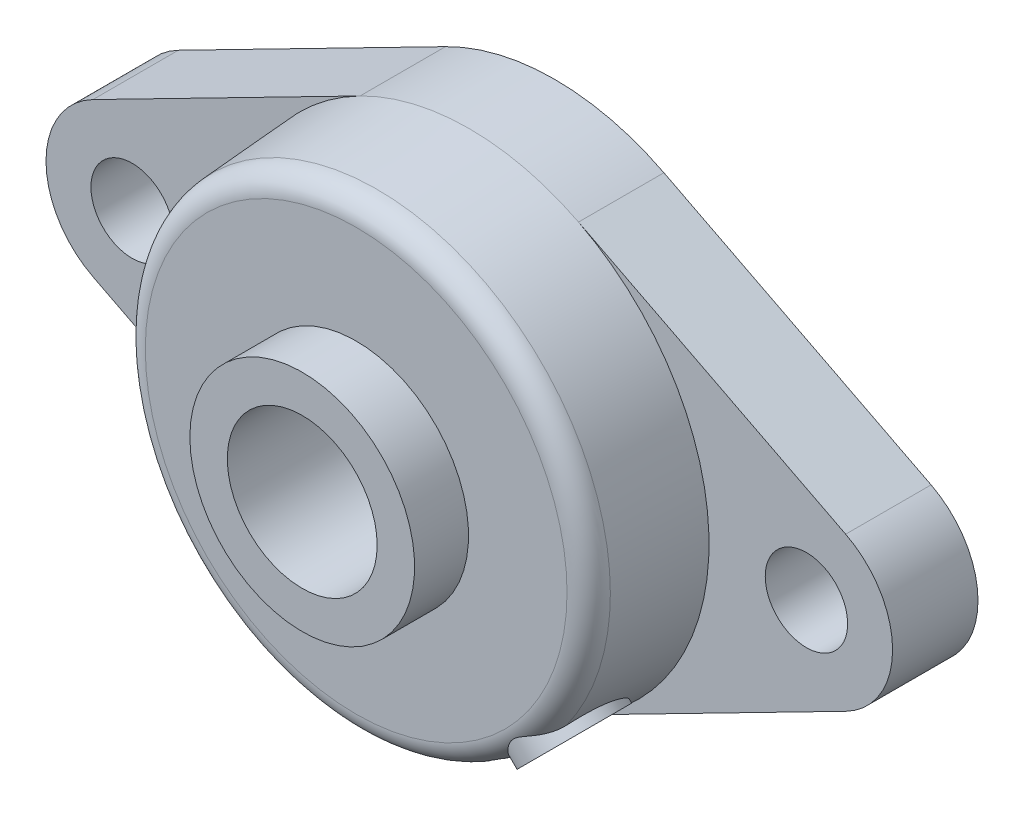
from build123d import *

# Parameters (mm, degrees)
ESQUISSE1_R             = 5.5
EXTRUSION1_DEPTH        = 11.4
ESQUISSE2_R             = 32
EXTRUSION2_DEPTH        = 15.1
EXTRUSION2_TAPER        = 4
CONG_1_R                = 3
ESQUISSE7_R             = 26
D_GAGEMENT_DEPTH        = 6
EXTRUSION3_DEPTH        = 7.2
EXTRUSION3_DEPTH_BACK   = 23.8
ESQUISSE3_R             = 15
ESQUISSE6_R             = 6.25
EXTRUSION4_DEPTH        = 32
ESQUISSE4_R             = 10
ENL_V_MAT_EXTRU_1_DEPTH = 74.1569546


with BuildPart() as part:
    # Esquisse1 → Extrusion1 (new body)
    with BuildSketch(Plane.XY):
        with BuildLine():
            Line((-50.238888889, 10.237384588), (-14.577777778, 28.486635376))
            ThreePointArc((-14.577777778, 28.486635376), (0, 32), (14.577777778, 28.486635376))
            Line((14.577777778, 28.486635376), (50.238888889, 10.237384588))
            ThreePointArc((50.238888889, 10.237384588), (56.5, 0), (50.238888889, -10.237384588))
            Line((50.238888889, -10.237384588), (14.577777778, -28.486635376))
            ThreePointArc((14.577777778, -28.486635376), (0, -32), (-14.577777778, -28.486635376))
            Line((-14.577777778, -28.486635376), (-50.238888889, -10.237384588))
            ThreePointArc((-50.238888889, -10.237384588), (-56.5, 0), (-50.238888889, 10.237384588))
        make_face()
        with Locations((-45, 0)):
            Circle(ESQUISSE1_R, mode=Mode.SUBTRACT)
        with Locations((45, 0)):
            Circle(ESQUISSE1_R, mode=Mode.SUBTRACT)
    extrude(amount=EXTRUSION1_DEPTH)

    # Esquisse2 → Extrusion2 (add)
    with BuildSketch(Plane.XY.offset(11.4)):
        Circle(ESQUISSE2_R)
    extrude(amount=EXTRUSION2_DEPTH, taper=EXTRUSION2_TAPER)

    # Cong_1
    cong_1_edges = [part.edges().sort_by_distance(p)[0] for p in [
        (-30.94410514, 0, 26.5),
    ]]
    fillet(cong_1_edges, radius=CONG_1_R)

    # Esquisse7 → D_gagement (cut)
    with BuildSketch(Plane(origin=(0, 0, 0), x_dir=(-1, 0, 0), z_dir=(0, 0, -1))):
        Circle(ESQUISSE7_R)
    extrude(amount=-D_GAGEMENT_DEPTH, mode=Mode.SUBTRACT)

    # Esquisse3 → Extrusion3 (add, two sides: drawn at the far end of the back side and taken through both)
    with BuildSketch(Plane.XY.offset(26.5).offset(-EXTRUSION3_DEPTH_BACK)):
        with Locations(Location((0, 0, 0), (0, 0, 180))):
            Circle(ESQUISSE3_R)
    extrude(amount=EXTRUSION3_DEPTH + EXTRUSION3_DEPTH_BACK)

    # Esquisse6 → Extrusion4 (add)
    with BuildSketch(Plane(origin=(0, 0, 0), x_dir=(0, 0, 1), z_dir=(-0.7071067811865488, 0.7071067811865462, 0))):
        with Locations(Location((20, 0, 0), (0, 0, 270))):
            Circle(ESQUISSE6_R)
    extrude(amount=-EXTRUSION4_DEPTH)

    # Esquisse4 → Enl_v. mat.-Extru.1 (cut, through all)
    with BuildSketch(Plane.XY.offset(33.7)):
        Circle(ESQUISSE4_R)
    extrude(amount=-ENL_V_MAT_EXTRU_1_DEPTH, mode=Mode.SUBTRACT)


solid = part.part
